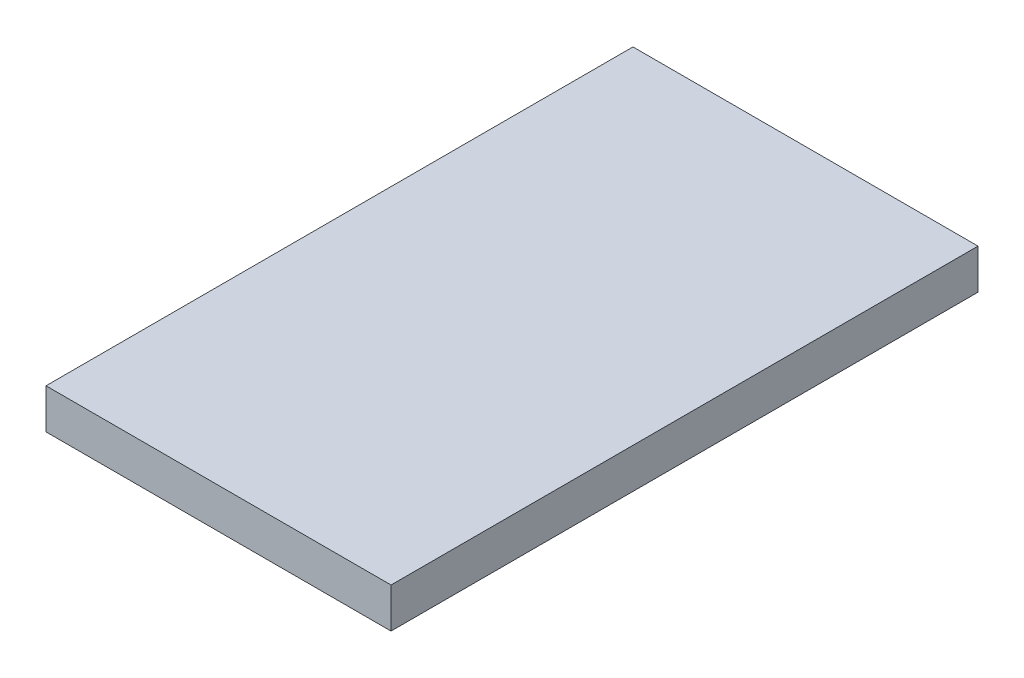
from build123d import *

# Parameters (mm, degrees)
SKETCH3_W           = 61.722
SKETCH3_H           = 7.14375
BOSS_EXTRUDE1_DEPTH = 52.5


with BuildPart() as part:
    # Sketch3 → Boss-Extrude1 (new, symmetric)
    with BuildSketch(Plane.XY):
        Rectangle(SKETCH3_W, SKETCH3_H)
    extrude(amount=BOSS_EXTRUDE1_DEPTH, both=True)


solid = part.part
